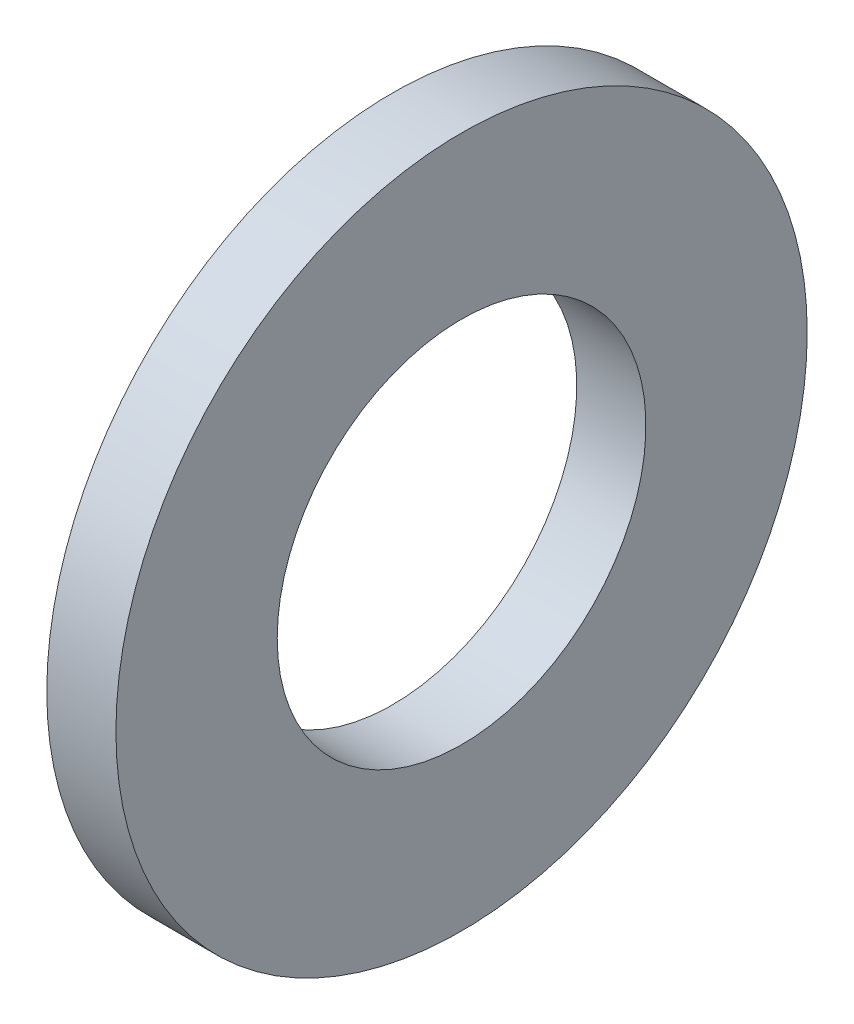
from build123d import *

# Parameters (mm, degrees)
ESQUISSE1_W = 1.2
ESQUISSE1_H = 2.8


with BuildPart() as part:
    # Esquisse1 → Base-R_volution (revolve)
    with BuildSketch(Plane(origin=(0, 0, 0), x_dir=(1, 0, 0), z_dir=(0, 1, 0)), mode=Mode.PRIVATE) as base_r_volution_sk:
        with Locations((0.6, 4.6)):
            Rectangle(ESQUISSE1_W, ESQUISSE1_H)
    revolve(base_r_volution_sk.sketch.rotate(Axis((0, 0, 0), (1, 0, 0)), 180), axis=Axis((0, 0, 0), (1, 0, 0)))


solid = part.part
